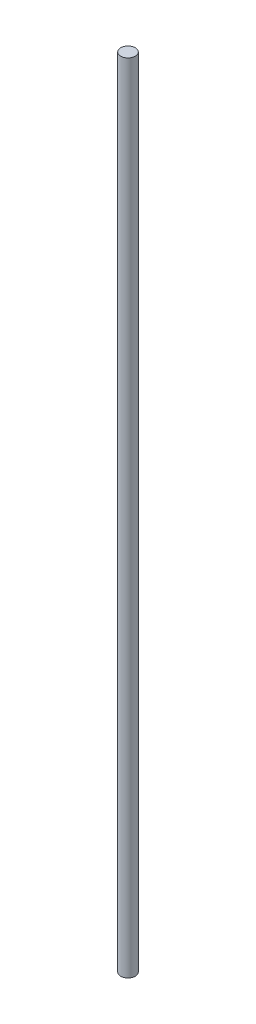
ISO-10303-21;
HEADER;
FILE_DESCRIPTION(('STEP AP214'),'2;1');
FILE_NAME('part.step','',(''),(''),'','','');
FILE_SCHEMA(('AUTOMOTIVE_DESIGN { 1 0 10303 214 1 1 1 1 }'));
ENDSEC;
DATA;
#1=APPLICATION_CONTEXT('core data for automotive mechanical design processes');
#2=APPLICATION_PROTOCOL_DEFINITION('international standard','automotive_design',2000,#1);
#3=PRODUCT_CONTEXT('',#1,'mechanical');
#4=PRODUCT('Part','Part','',(#3));
#5=PRODUCT_RELATED_PRODUCT_CATEGORY('part','',(#4));
#6=PRODUCT_DEFINITION_FORMATION('','',#4);
#7=PRODUCT_DEFINITION_CONTEXT('part definition',#1,'design');
#8=PRODUCT_DEFINITION('design','',#6,#7);
#9=PRODUCT_DEFINITION_SHAPE('','',#8);
#10=(LENGTH_UNIT() NAMED_UNIT(*) SI_UNIT(.MILLI.,.METRE.));
#11=(NAMED_UNIT(*) PLANE_ANGLE_UNIT() SI_UNIT($,.RADIAN.));
#12=(NAMED_UNIT(*) SI_UNIT($,.STERADIAN.) SOLID_ANGLE_UNIT());
#13=UNCERTAINTY_MEASURE_WITH_UNIT(LENGTH_MEASURE(1.E-05),#10,'distance_accuracy_value','');
#14=(GEOMETRIC_REPRESENTATION_CONTEXT(3) GLOBAL_UNCERTAINTY_ASSIGNED_CONTEXT((#13)) GLOBAL_UNIT_ASSIGNED_CONTEXT((#10,
#11,#12)) REPRESENTATION_CONTEXT('',''));
#15=CARTESIAN_POINT('',(0.,0.,0.));
#16=DIRECTION('',(0.,0.,1.));
#17=DIRECTION('',(1.,0.,0.));
#18=AXIS2_PLACEMENT_3D('',#15,#16,#17);
#19=CARTESIAN_POINT('',(0.,76.2,0.));
#20=DIRECTION('',(0.,-1.,0.));
#21=DIRECTION('',(0.,0.,-1.));
#22=AXIS2_PLACEMENT_3D('',#19,#20,#21);
#23=CYLINDRICAL_SURFACE('',#22,1.397);
#24=CARTESIAN_POINT('',(0.,76.2,0.));
#25=DIRECTION('',(0.,1.,0.));
#26=DIRECTION('',(0.,0.,1.));
#27=AXIS2_PLACEMENT_3D('',#24,#25,#26);
#28=CIRCLE('',#27,1.397);
#29=CARTESIAN_POINT('',(0.,76.2,-1.397));
#30=VERTEX_POINT('',#29);
#31=EDGE_CURVE('E10',#30,#30,#28,.T.);
#32=CARTESIAN_POINT('',(0.,-76.2,0.));
#33=DIRECTION('',(0.,1.,0.));
#34=DIRECTION('',(0.,0.,1.));
#35=AXIS2_PLACEMENT_3D('',#32,#33,#34);
#36=CIRCLE('',#35,1.397);
#37=CARTESIAN_POINT('',(0.,-76.2,-1.397));
#38=VERTEX_POINT('',#37);
#39=EDGE_CURVE('E30',#38,#38,#36,.T.);
#40=CARTESIAN_POINT('',(0.,76.2,-1.397));
#41=CARTESIAN_POINT('',(0.,74.6125,-1.397));
#42=CARTESIAN_POINT('',(0.,73.025,-1.397));
#43=CARTESIAN_POINT('',(0.,69.85,-1.397));
#44=CARTESIAN_POINT('',(0.,68.2625,-1.397));
#45=CARTESIAN_POINT('',(0.,65.0875,-1.397));
#46=CARTESIAN_POINT('',(0.,63.5,-1.397));
#47=CARTESIAN_POINT('',(0.,60.325,-1.397));
#48=CARTESIAN_POINT('',(0.,58.7375,-1.397));
#49=CARTESIAN_POINT('',(0.,55.5625,-1.397));
#50=CARTESIAN_POINT('',(0.,53.975,-1.397));
#51=CARTESIAN_POINT('',(0.,50.8,-1.397));
#52=CARTESIAN_POINT('',(0.,49.2125,-1.397));
#53=CARTESIAN_POINT('',(0.,46.0375,-1.397));
#54=CARTESIAN_POINT('',(0.,44.45,-1.397));
#55=CARTESIAN_POINT('',(0.,41.275,-1.397));
#56=CARTESIAN_POINT('',(0.,39.6875,-1.397));
#57=CARTESIAN_POINT('',(0.,36.5125,-1.397));
#58=CARTESIAN_POINT('',(0.,34.925,-1.397));
#59=CARTESIAN_POINT('',(0.,31.75,-1.397));
#60=CARTESIAN_POINT('',(0.,30.1625,-1.397));
#61=CARTESIAN_POINT('',(0.,26.9875,-1.397));
#62=CARTESIAN_POINT('',(0.,25.4,-1.397));
#63=CARTESIAN_POINT('',(0.,22.225,-1.397));
#64=CARTESIAN_POINT('',(0.,20.6375,-1.397));
#65=CARTESIAN_POINT('',(0.,17.4625,-1.397));
#66=CARTESIAN_POINT('',(0.,15.875,-1.397));
#67=CARTESIAN_POINT('',(0.,12.7,-1.397));
#68=CARTESIAN_POINT('',(0.,11.1125,-1.397));
#69=CARTESIAN_POINT('',(0.,7.93750000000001,-1.397));
#70=CARTESIAN_POINT('',(0.,6.35,-1.397));
#71=CARTESIAN_POINT('',(0.,3.175,-1.397));
#72=CARTESIAN_POINT('',(0.,1.5875,-1.397));
#73=CARTESIAN_POINT('',(0.,-1.5875,-1.397));
#74=CARTESIAN_POINT('',(0.,-3.175,-1.397));
#75=CARTESIAN_POINT('',(0.,-6.35,-1.397));
#76=CARTESIAN_POINT('',(0.,-7.93750000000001,-1.397));
#77=CARTESIAN_POINT('',(0.,-11.1125,-1.397));
#78=CARTESIAN_POINT('',(0.,-12.7,-1.397));
#79=CARTESIAN_POINT('',(0.,-15.875,-1.397));
#80=CARTESIAN_POINT('',(0.,-17.4625,-1.397));
#81=CARTESIAN_POINT('',(0.,-20.6375,-1.397));
#82=CARTESIAN_POINT('',(0.,-22.225,-1.397));
#83=CARTESIAN_POINT('',(0.,-25.4,-1.397));
#84=CARTESIAN_POINT('',(0.,-26.9875,-1.397));
#85=CARTESIAN_POINT('',(0.,-30.1625,-1.397));
#86=CARTESIAN_POINT('',(0.,-31.75,-1.397));
#87=CARTESIAN_POINT('',(0.,-34.925,-1.397));
#88=CARTESIAN_POINT('',(0.,-36.5125,-1.397));
#89=CARTESIAN_POINT('',(0.,-39.6875,-1.397));
#90=CARTESIAN_POINT('',(0.,-41.275,-1.397));
#91=CARTESIAN_POINT('',(0.,-44.45,-1.397));
#92=CARTESIAN_POINT('',(0.,-46.0375,-1.397));
#93=CARTESIAN_POINT('',(0.,-49.2125,-1.397));
#94=CARTESIAN_POINT('',(0.,-50.8,-1.397));
#95=CARTESIAN_POINT('',(0.,-53.975,-1.397));
#96=CARTESIAN_POINT('',(0.,-55.5625,-1.397));
#97=CARTESIAN_POINT('',(0.,-58.7375,-1.397));
#98=CARTESIAN_POINT('',(0.,-60.325,-1.397));
#99=CARTESIAN_POINT('',(0.,-63.5,-1.397));
#100=CARTESIAN_POINT('',(0.,-65.0875,-1.397));
#101=CARTESIAN_POINT('',(0.,-68.2625,-1.397));
#102=CARTESIAN_POINT('',(0.,-69.85,-1.397));
#103=CARTESIAN_POINT('',(0.,-73.025,-1.397));
#104=CARTESIAN_POINT('',(0.,-74.6125,-1.397));
#105=CARTESIAN_POINT('',(0.,-76.2,-1.397));
#106=B_SPLINE_CURVE_WITH_KNOTS('',3,(#40,#41,#42,#43,#44,#45,#46,#47,#48,#49,#50,#51,#52,#53,
#54,#55,#56,#57,#58,#59,#60,#61,#62,#63,#64,#65,#66,#67,#68,#69,#70,#71,#72,#73,#74,#75,#76,#77,
#78,#79,#80,#81,#82,#83,#84,#85,#86,#87,#88,#89,#90,#91,#92,#93,#94,#95,#96,#97,#98,#99,#100,
#101,#102,#103,#104,#105),.UNSPECIFIED.,.F.,.F.,(4,2,2,2,2,2,2,2,2,2,2,2,2,2,2,2,2,2,2,2,2,2,2,
2,2,2,2,2,2,2,2,2,4),(0.,4.7625,9.52500000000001,14.2875,19.05,23.8125,28.575,33.3375,38.1,
42.8625,47.625,52.3875,57.15,61.9125,66.675,71.4375,76.2,80.9625,85.725,90.4875,95.25,100.0125,
104.775,109.5375,114.3,119.0625,123.825,128.5875,133.35,138.1125,142.875,147.6375,152.4),.UNSPECIFIED.);
#107=EDGE_CURVE('BSEAM24',#30,#38,#106,.T.);
#108=ORIENTED_EDGE('',*,*,#31,.F.);
#109=ORIENTED_EDGE('',*,*,#39,.T.);
#110=ORIENTED_EDGE('',*,*,#107,.T.);
#111=ORIENTED_EDGE('',*,*,#107,.F.);
#112=EDGE_LOOP('',(#108,#110,#109,#111));
#113=FACE_BOUND('',#112,.T.);
#114=ADVANCED_FACE('F24',(#113),#23,.T.);
#115=CARTESIAN_POINT('',(0.,76.2,0.));
#116=DIRECTION('',(0.,1.,0.));
#117=DIRECTION('',(0.,0.,1.));
#118=AXIS2_PLACEMENT_3D('',#115,#116,#117);
#119=PLANE('',#118);
#120=ORIENTED_EDGE('',*,*,#31,.T.);
#121=EDGE_LOOP('',(#120));
#122=FACE_BOUND('',#121,.T.);
#123=ADVANCED_FACE('F39',(#122),#119,.T.);
#124=CARTESIAN_POINT('',(0.,-76.2,0.));
#125=DIRECTION('',(0.,1.,0.));
#126=DIRECTION('',(0.,0.,1.));
#127=AXIS2_PLACEMENT_3D('',#124,#125,#126);
#128=PLANE('',#127);
#129=ORIENTED_EDGE('',*,*,#39,.F.);
#130=EDGE_LOOP('',(#129));
#131=FACE_BOUND('',#130,.T.);
#132=ADVANCED_FACE('F37',(#131),#128,.F.);
#133=CLOSED_SHELL('',(#114,#123,#132));
#134=MANIFOLD_SOLID_BREP('B2',#133);
#135=ADVANCED_BREP_SHAPE_REPRESENTATION('',(#18,#134),#14);
#136=SHAPE_DEFINITION_REPRESENTATION(#9,#135);
ENDSEC;
END-ISO-10303-21;
